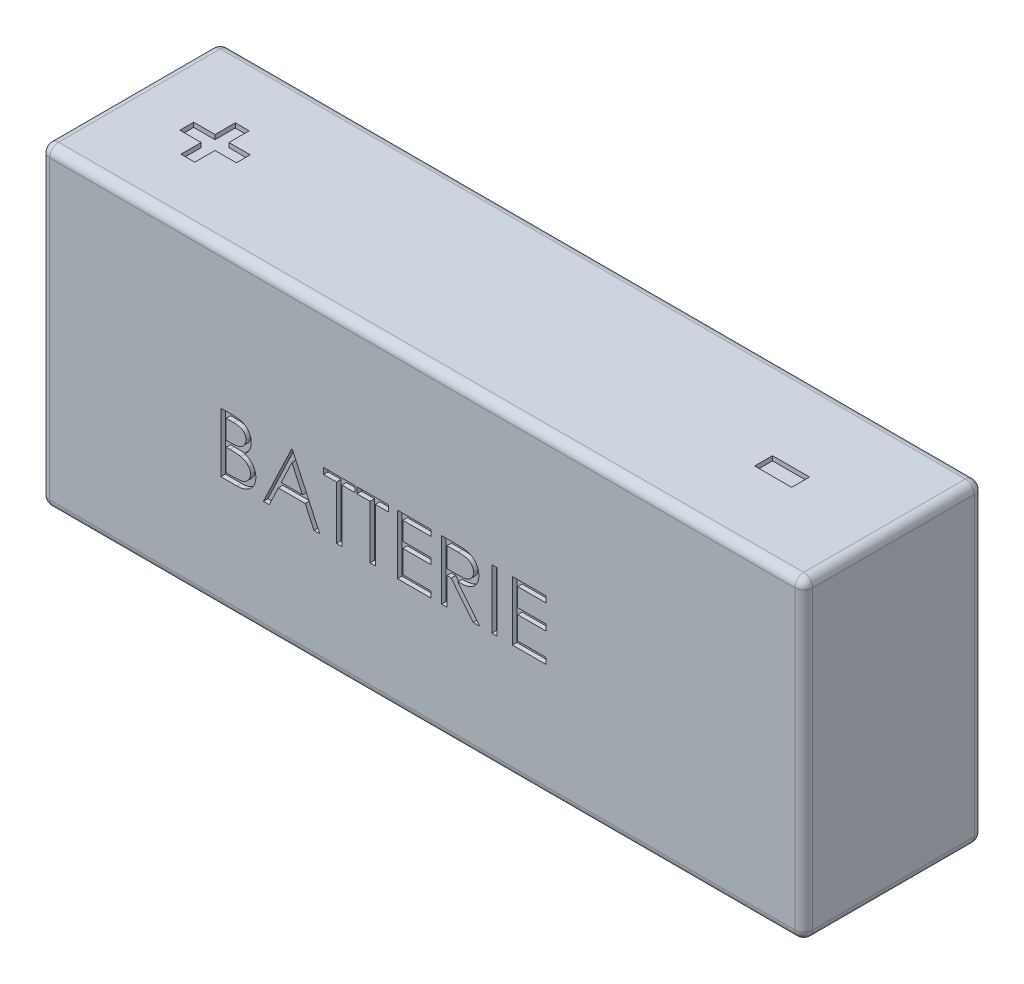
from build123d import *

# Parameters (mm, degrees)
ESQUISSE1_W             = 170
ESQUISSE1_H             = 70
BOSS_EXTRU_1_DEPTH      = 40
CONG_1_R                = 2
ESQUISSE2_W             = 1.187232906
ESQUISSE2_H             = 13.229166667
ENL_V_MAT_EXTRU_1_DEPTH = 1
ENL_V_MAT_EXTRU_2_DEPTH = 1
ESQUISSE4_W             = 8.242788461
ESQUISSE4_H             = 3.96875
ENL_V_MAT_EXTRU_3_DEPTH = 1


with BuildPart() as part:
    # Esquisse1 → Boss.-Extru.1 (new body)
    with BuildSketch(Plane.XY):
        with Locations((85, -35)):
            Rectangle(ESQUISSE1_W, ESQUISSE1_H)
    extrude(amount=BOSS_EXTRU_1_DEPTH)

    # Cong_1
    cong_1_edges = [part.edges().sort_by_distance(p)[0] for p in [
        (170, -35, 40),
        (85, 0, 40),
        (0, -35, 40),
        (85, 0, 0),
        (170, -35, 0),
        (85, -70, 0),
        (0, -35, 0),
        (85, -70, 40),
        (0, 0, 20),
        (170, 0, 20),
        (170, -70, 20),
        (0, -70, 20),
    ]]
    fillet(cong_1_edges, radius=CONG_1_R)

    # Esquisse2 → Enl_v. mat.-Extru.1 (cut)
    # profile 1 of 8: a face of its own
    with BuildSketch(Plane.XY.offset(40)):
        with BuildLine():
            Line((40.124069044, -31.256135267), (42.705240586, -31.256135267))
            add(Edge.make_bspline(
                [(42.705240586, -31.256135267), (42.831592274, -31.256799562), (43.076493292, -31.25808713), (43.432620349, -31.278056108), (43.766179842, -31.305284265), (44.077268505, -31.348487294), (44.365742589, -31.400616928), (44.632471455, -31.463745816), (44.876606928, -31.539441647), (45.168074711, -31.659813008), (45.500393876, -31.838683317), (45.860221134, -32.102996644), (46.167909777, -32.426288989), (46.433197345, -32.790970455), (46.644112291, -33.192138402), (46.796698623, -33.620231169), (46.893301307, -34.069727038), (46.903236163, -34.378318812), (46.908257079, -34.534276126)],
                knots=[0, 0, 0, 0, 1.001505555, 1.941167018, 2.826882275, 3.653841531, 4.429895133, 5.150066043, 5.825578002, 6.45369114, 7.647487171, 8.808567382, 9.977351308, 11.170798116, 12.373658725, 13.556498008, 14.765093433, 16, 16, 16, 16], degree=3))
            add(Edge.make_bspline(
                [(46.908257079, -34.534276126), (46.904124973, -34.680373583), (46.896004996, -34.967468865), (46.818358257, -35.387378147), (46.696798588, -35.787092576), (46.52782339, -36.165153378), (46.308211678, -36.513018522), (46.047943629, -36.833494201), (45.733933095, -37.113011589), (45.498668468, -37.269277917), (45.379164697, -37.348654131)],
                knots=[0, 0, 0, 0, 1.044552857, 2.05264487, 3.044412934, 4.028983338, 5.005914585, 5.980388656, 6.974128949, 8, 8, 8, 8], degree=3))
            add(Edge.make_bspline(
                [(45.379164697, -37.348654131), (45.529449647, -37.406352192), (45.816981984, -37.516742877), (46.212670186, -37.711912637), (46.553585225, -37.924192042), (46.842348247, -38.156011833), (47.089309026, -38.405887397), (47.304955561, -38.677482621), (47.488959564, -38.974340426), (47.646624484, -39.293365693), (47.769651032, -39.631300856), (47.861786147, -39.984976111), (47.914579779, -40.35312324), (47.92209259, -40.603666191), (47.925885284, -40.730147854)],
                knots=[0, 0, 0, 0, 1.27268992, 2.434971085, 3.483601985, 4.442670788, 5.356604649, 6.2567628, 7.179492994, 8.113709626, 9.066344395, 10.018646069, 10.999752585, 12, 12, 12, 12], degree=3))
            add(Edge.make_bspline(
                [(47.925885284, -40.730147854), (47.922193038, -40.859290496), (47.914928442, -41.113382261), (47.861331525, -41.486653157), (47.770582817, -41.843367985), (47.645581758, -42.185834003), (47.482438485, -42.513388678), (47.283895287, -42.826403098), (47.047162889, -43.121732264), (46.782341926, -43.402657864), (46.482749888, -43.655250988), (46.159520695, -43.880206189), (45.808583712, -44.06521065), (45.435702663, -44.220619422), (45.036694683, -44.339331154), (44.613351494, -44.422382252), (44.16603821, -44.478341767), (43.859084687, -44.482942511), (43.701668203, -44.485301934)],
                knots=[0, 0, 0, 0, 0.978564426, 1.925352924, 2.850884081, 3.763762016, 4.682927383, 5.618979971, 6.567305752, 7.547517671, 8.540179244, 9.531824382, 10.526200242, 11.540722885, 12.589160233, 13.674978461, 14.80764778, 16, 16, 16, 16], degree=3))
            Line((43.701668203, -44.485301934), (40.124069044, -44.485301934))
            Line((40.124069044, -44.485301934), (40.124069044, -31.256135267))
        make_face()
        with BuildLine():
            Line((41.31130195, -32.612972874), (41.31130195, -36.853090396))
            Line((41.31130195, -36.853090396), (42.108974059, -36.853090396))
            add(Edge.make_bspline(
                [(42.108974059, -36.853090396), (42.225575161, -36.851578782), (42.450872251, -36.848658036), (42.777140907, -36.840291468), (43.079994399, -36.81686434), (43.358909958, -36.793443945), (43.613448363, -36.755364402), (43.843045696, -36.710037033), (44.051305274, -36.662098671), (44.291469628, -36.580571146), (44.563888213, -36.460081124), (44.854299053, -36.273089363), (45.11031922, -36.050369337), (45.326510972, -35.79337969), (45.503447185, -35.510403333), (45.626341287, -35.205955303), (45.709674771, -34.887623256), (45.717202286, -34.669084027), (45.721024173, -34.558126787)],
                knots=[0, 0, 0, 0, 1.156816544, 2.235205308, 3.236616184, 4.169592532, 5.011045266, 5.787822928, 6.49130361, 7.128639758, 8.301311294, 9.436451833, 10.541879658, 11.654887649, 12.756523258, 13.837046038, 14.901820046, 16, 16, 16, 16], degree=3))
            add(Edge.make_bspline(
                [(45.721024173, -34.558126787), (45.719035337, -34.484701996), (45.715134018, -34.34067125), (45.683182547, -34.130707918), (45.628876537, -33.933238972), (45.559123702, -33.745558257), (45.461648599, -33.5735343), (45.346881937, -33.411219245), (45.208218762, -33.264140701), (45.050386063, -33.126672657), (44.868924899, -33.004796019), (44.663943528, -32.898052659), (44.432668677, -32.812097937), (44.178998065, -32.736819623), (43.89902699, -32.683947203), (43.595986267, -32.639900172), (43.267393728, -32.61747582), (43.040059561, -32.614507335), (42.922546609, -32.612972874)],
                knots=[0, 0, 0, 0, 0.91205012, 1.789085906, 2.630437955, 3.453916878, 4.269457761, 5.079663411, 5.91843418, 6.774407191, 7.675494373, 8.627863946, 9.638891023, 10.736472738, 11.911756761, 13.175263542, 14.539845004, 16, 16, 16, 16], degree=3))
            Line((42.922546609, -32.612972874), (41.31130195, -32.612972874))
        make_face(mode=Mode.SUBTRACT)
        with BuildLine():
            Line((41.31130195, -38.209928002), (41.31130195, -43.128464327))
            Line((41.31130195, -43.128464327), (43.002048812, -43.128464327))
            add(Edge.make_bspline(
                [(43.002048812, -43.128464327), (43.123072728, -43.127013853), (43.356330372, -43.124218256), (43.693111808, -43.115091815), (44.005256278, -43.094332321), (44.29133941, -43.061653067), (44.554450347, -43.026204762), (44.791432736, -42.978537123), (45.004207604, -42.923923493), (45.250928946, -42.839505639), (45.528754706, -42.70836124), (45.828152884, -42.51062592), (46.09434722, -42.275058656), (46.320396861, -42.002420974), (46.505654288, -41.705969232), (46.640423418, -41.391699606), (46.723543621, -41.064804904), (46.733605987, -40.841924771), (46.738652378, -40.730147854)],
                knots=[0, 0, 0, 0, 1.160039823, 2.235823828, 3.228722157, 4.157150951, 4.99529583, 5.772374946, 6.472645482, 7.099169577, 8.269452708, 9.405989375, 10.527446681, 11.663510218, 12.788923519, 13.866172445, 14.929861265, 16, 16, 16, 16], degree=3))
            add(Edge.make_bspline(
                [(46.738652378, -40.730147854), (46.737608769, -40.66024743), (46.735538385, -40.521574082), (46.704315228, -40.317785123), (46.65890566, -40.120383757), (46.600200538, -39.928833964), (46.514704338, -39.74659888), (46.414893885, -39.570074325), (46.297867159, -39.399026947), (46.115515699, -39.182778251), (45.850282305, -38.933627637), (45.473414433, -38.689691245), (45.04489414, -38.492962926), (44.734093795, -38.409432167), (44.573542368, -38.366282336)],
                knots=[0, 0, 0, 0, 0.723448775, 1.435228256, 2.130040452, 2.821711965, 3.505591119, 4.210454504, 4.921174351, 5.648778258, 7.137944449, 8.670945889, 10.280296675, 12, 12, 12, 12], degree=3))
            add(Edge.make_bspline(
                [(44.573542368, -38.366282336), (44.509176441, -38.353222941), (44.369617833, -38.32490748), (44.142047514, -38.295018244), (43.882242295, -38.268389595), (43.589602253, -38.24869266), (43.263757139, -38.228332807), (42.904011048, -38.220414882), (42.511833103, -38.210968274), (42.239719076, -38.21028363), (42.098373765, -38.209928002)],
                knots=[0, 0, 0, 0, 0.634451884, 1.375622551, 2.216452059, 3.157844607, 4.20941857, 5.370758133, 6.634282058, 8, 8, 8, 8], degree=3))
            Line((42.098373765, -38.209928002), (41.31130195, -38.209928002))
        make_face(mode=Mode.SUBTRACT)
    # profile 2 of 8: a face of its own
    with BuildSketch(Plane.XY.offset(40)):
        Polygon((56.066910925, -31.256135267), (62.172680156, -44.485301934), (60.882094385, -44.485301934), (58.926340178, -40.245184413), (52.929223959, -40.245184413), (50.91781821, -44.485301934), (49.621932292, -44.485301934), (55.897306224, -31.256135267), align=None)
        Polygon((55.968858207, -33.834656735), (53.573191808, -38.888346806), (58.300922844, -38.888346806), align=None, mode=Mode.SUBTRACT)
    # profile 3 of 8: a face of its own
    with BuildSketch(Plane.XY.offset(40)):
        Polygon((63.02070366, -32.612972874), (63.02070366, -31.256135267), (69.974496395, -31.256135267), (69.974496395, -32.612972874), (67.09121648, -32.612972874), (67.09121648, -44.485301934), (65.903983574, -44.485301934), (65.903983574, -32.612972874), align=None)
    # profile 4 of 8: a face of its own
    with BuildSketch(Plane.XY.offset(40)):
        Polygon((70.483310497, -32.612972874), (70.483310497, -31.256135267), (77.437103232, -31.256135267), (77.437103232, -32.612972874), (74.553823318, -32.612972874), (74.553823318, -44.485301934), (73.366590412, -44.485301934), (73.366590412, -32.612972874), align=None)
    # profile 5 of 8: a face of its own
    with BuildSketch(Plane.XY.offset(40)):
        Polygon((79.472359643, -31.256135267), (86.93496648, -31.256135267), (86.93496648, -32.612972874), (80.659592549, -32.612972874), (80.659592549, -36.683485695), (86.93496648, -36.683485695), (86.93496648, -38.040323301), (80.659592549, -38.040323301), (80.659592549, -43.128464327), (86.93496648, -43.128464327), (86.93496648, -44.485301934), (79.472359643, -44.485301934), align=None)
    # profile 6 of 8: a face of its own
    with BuildSketch(Plane.XY.offset(40)):
        with BuildLine():
            Line((89.309432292, -31.256135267), (91.95685567, -31.256135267))
            add(Edge.make_bspline(
                [(91.95685567, -31.256135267), (92.133526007, -31.256723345), (92.472752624, -31.25785252), (92.958728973, -31.264148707), (93.400307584, -31.282194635), (93.797257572, -31.297724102), (94.149571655, -31.326041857), (94.458330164, -31.353107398), (94.722111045, -31.388537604), (94.881790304, -31.42144203), (94.954088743, -31.436340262)],
                knots=[0, 0, 0, 0, 1.410062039, 2.707475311, 3.878576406, 4.937260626, 5.877586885, 6.699081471, 7.410979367, 8, 8, 8, 8], degree=3))
            add(Edge.make_bspline(
                [(94.954088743, -31.436340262), (95.050875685, -31.460253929), (95.242384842, -31.507571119), (95.518118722, -31.60758211), (95.780866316, -31.723317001), (96.029536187, -31.859251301), (96.262882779, -32.016394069), (96.483312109, -32.192032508), (96.691824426, -32.385205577), (96.879987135, -32.600783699), (97.057405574, -32.826951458), (97.207041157, -33.071516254), (97.336031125, -33.327260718), (97.43872921, -33.596785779), (97.52142274, -33.877477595), (97.579730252, -34.171878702), (97.614697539, -34.478647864), (97.618257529, -34.687887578), (97.620062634, -34.793983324)],
                knots=[0, 0, 0, 0, 1.027469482, 2.033020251, 3.019912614, 3.986113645, 4.951240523, 5.91722682, 6.890402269, 7.87763091, 8.8651537, 9.85103654, 10.82876324, 11.815024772, 12.821070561, 13.842952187, 14.906261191, 16, 16, 16, 16], degree=3))
            add(Edge.make_bspline(
                [(97.620062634, -34.793983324), (97.614510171, -34.970252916), (97.603675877, -35.314200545), (97.502661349, -35.813359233), (97.337196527, -36.278985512), (97.109188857, -36.710493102), (96.818829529, -37.099470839), (96.469863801, -37.441125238), (96.062096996, -37.727026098), (95.682498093, -37.925285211), (95.347179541, -38.052258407), (95.071131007, -38.141598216), (94.770008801, -38.210624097), (94.446698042, -38.2724615), (94.099853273, -38.319147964), (93.730305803, -38.353341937), (93.337792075, -38.374712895), (93.068147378, -38.377895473), (92.929432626, -38.379532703)],
                knots=[0, 0, 0, 0, 1.260483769, 2.459530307, 3.627416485, 4.787058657, 5.939039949, 7.08810263, 8.267026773, 9.491475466, 10.141966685, 10.831826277, 11.566392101, 12.351337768, 13.187381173, 14.07005841, 15.007169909, 16, 16, 16, 16], degree=3))
            Line((92.929432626, -38.379532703), (97.789667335, -44.485301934))
            Line((97.789667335, -44.485301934), (96.321526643, -44.485301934))
            Line((96.321526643, -44.485301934), (91.461291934, -38.379532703))
            Line((91.461291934, -38.379532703), (90.496665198, -38.379532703))
            Line((90.496665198, -38.379532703), (90.496665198, -44.485301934))
            Line((90.496665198, -44.485301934), (89.309432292, -44.485301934))
            Line((89.309432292, -44.485301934), (89.309432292, -31.256135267))
        make_face()
        with BuildLine():
            Line((90.496665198, -32.612972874), (90.496665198, -37.022695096))
            Line((90.496665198, -37.022695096), (92.918832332, -37.041245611))
            add(Edge.make_bspline(
                [(92.918832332, -37.041245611), (93.031922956, -37.041295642), (93.251124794, -37.041392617), (93.56824933, -37.026297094), (93.863524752, -37.009124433), (94.135821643, -36.982857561), (94.385261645, -36.949005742), (94.611720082, -36.906661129), (94.815566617, -36.85732744), (95.053308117, -36.780970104), (95.318785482, -36.659994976), (95.607300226, -36.483988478), (95.852993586, -36.262611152), (96.06057003, -36.009467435), (96.227368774, -35.731139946), (96.344964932, -35.430964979), (96.419586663, -35.116520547), (96.428388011, -34.900400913), (96.432829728, -34.791333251)],
                knots=[0, 0, 0, 0, 1.146690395, 2.22261258, 3.21895312, 4.145990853, 4.996080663, 5.770904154, 6.481378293, 7.121626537, 8.300444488, 9.431385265, 10.535395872, 11.636531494, 12.74115979, 13.810798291, 14.895190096, 16, 16, 16, 16], degree=3))
            add(Edge.make_bspline(
                [(96.432829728, -34.791333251), (96.428285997, -34.684945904), (96.419281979, -34.474125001), (96.345770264, -34.165485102), (96.221456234, -33.87419038), (96.053928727, -33.601425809), (95.849824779, -33.353829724), (95.610498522, -33.14198483), (95.342493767, -32.967172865), (95.092004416, -32.855464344), (94.868113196, -32.786975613), (94.673721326, -32.73877925), (94.454073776, -32.700057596), (94.208104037, -32.66903308), (93.936862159, -32.642367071), (93.638976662, -32.624406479), (93.316423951, -32.613770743), (93.092862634, -32.61324502), (92.977133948, -32.612972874)],
                knots=[0, 0, 0, 0, 1.101028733, 2.181837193, 3.264309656, 4.369019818, 5.486613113, 6.575447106, 7.666700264, 8.788928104, 9.402425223, 10.0903467, 10.862060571, 11.710948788, 12.657782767, 13.684531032, 14.801375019, 16, 16, 16, 16], degree=3))
            Line((92.977133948, -32.612972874), (90.496665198, -32.612972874))
        make_face(mode=Mode.SUBTRACT)
    # profile 7 of 8: a face of its own
    with BuildSketch(Plane.XY.offset(40)):
        with Locations((101.096959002, -37.870718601)):
            Rectangle(ESQUISSE2_W, ESQUISSE2_H)
    # profile 8 of 8: a face of its own
    with BuildSketch(Plane.XY.offset(40)):
        Polygon((105.082669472, -31.256135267), (112.545276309, -31.256135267), (112.545276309, -32.612972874), (106.269902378, -32.612972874), (106.269902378, -36.683485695), (112.545276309, -36.683485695), (112.545276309, -38.040323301), (106.269902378, -38.040323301), (106.269902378, -43.128464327), (112.545276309, -43.128464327), (112.545276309, -44.485301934), (105.082669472, -44.485301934), align=None)
    extrude(amount=-ENL_V_MAT_EXTRU_1_DEPTH, mode=Mode.SUBTRACT)

    # Esquisse3 → Enl_v. mat.-Extru.2 (cut)
    with BuildSketch(Plane(origin=(0, 0, 0), x_dir=(1, 0, 0), z_dir=(0, 1, 0))):
        Polygon((17.940243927, -19.099332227), (17.940243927, -14.587847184), (21.027049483, -14.587847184), (21.027049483, -19.099332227), (25.775981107, -19.099332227), (25.775981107, -22.186137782), (21.027049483, -22.186137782), (21.027049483, -26.697622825), (17.940243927, -26.697622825), (17.940243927, -22.186137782), (13.191312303, -22.186137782), (13.191312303, -19.099332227), align=None)
    extrude(amount=-ENL_V_MAT_EXTRU_2_DEPTH, mode=Mode.SUBTRACT)

    # Esquisse4 → Enl_v. mat.-Extru.3 (cut)
    with BuildSketch(Plane(origin=(0, 0, 0), x_dir=(1, 0, 0), z_dir=(0, 1, 0))):
        with Locations((146.1317537, -20.955487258)):
            Rectangle(ESQUISSE4_W, ESQUISSE4_H)
    extrude(amount=-ENL_V_MAT_EXTRU_3_DEPTH, mode=Mode.SUBTRACT)


solid = part.part
